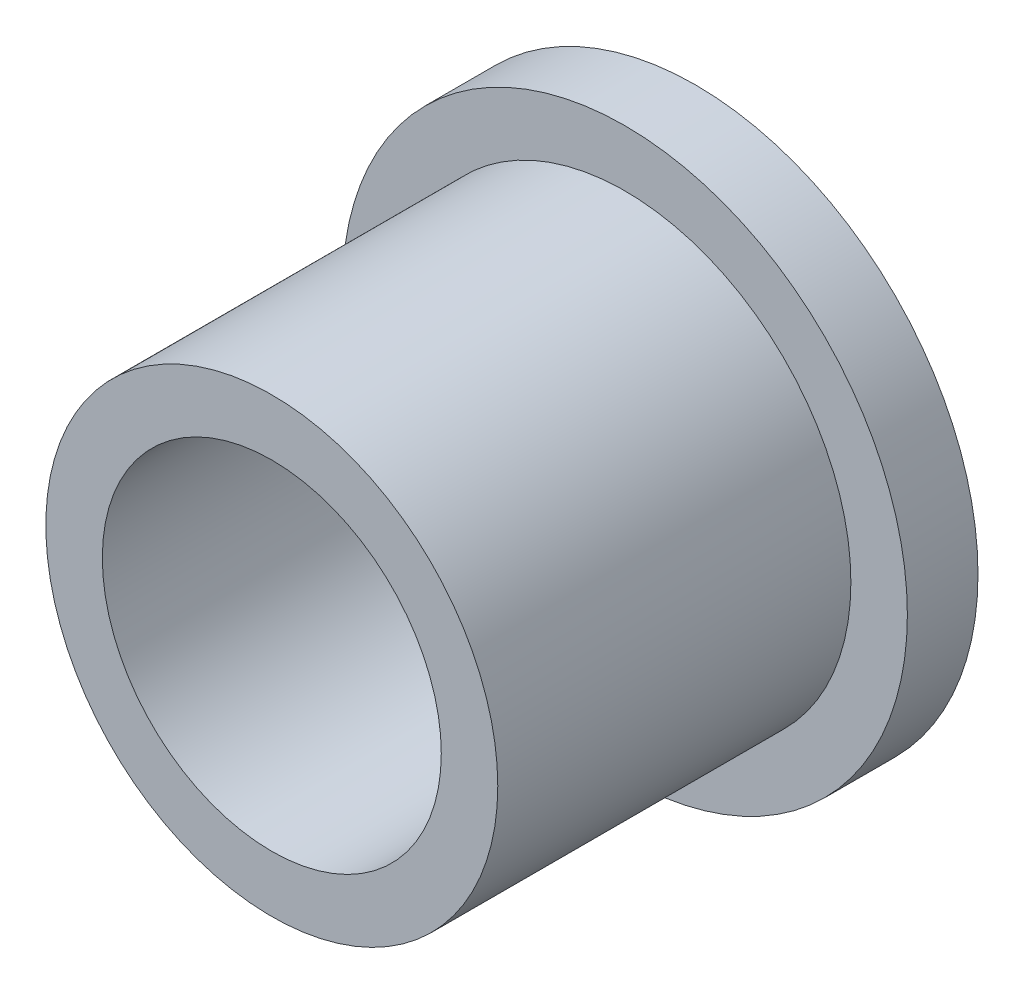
from build123d import *

# Parameters (mm, degrees)
SKETCH1_R          = 20
EXTRUDE1_DEPTH     = 5
SKETCH2_R          = 16
EXTRUDE2_DEPTH     = 25
SKETCH3_R          = 12
CUT_EXTRUDE1_DEPTH = 42.231056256


with BuildPart() as part:
    # Sketch1 → Extrude1 (new body)
    with BuildSketch(Plane.XY):
        Circle(SKETCH1_R)
    extrude(amount=EXTRUDE1_DEPTH)

    # Sketch2 → Extrude2 (add)
    with BuildSketch(Plane.XY.offset(5)):
        Circle(SKETCH2_R)
    extrude(amount=EXTRUDE2_DEPTH)

    # Sketch3 → Cut-Extrude1 (cut, through all)
    with BuildSketch(Plane(origin=(0, 0, 0), x_dir=(-1, 0, 0), z_dir=(0, 0, -1))):
        Circle(SKETCH3_R)
    extrude(amount=-CUT_EXTRUDE1_DEPTH, mode=Mode.SUBTRACT)


solid = part.part
